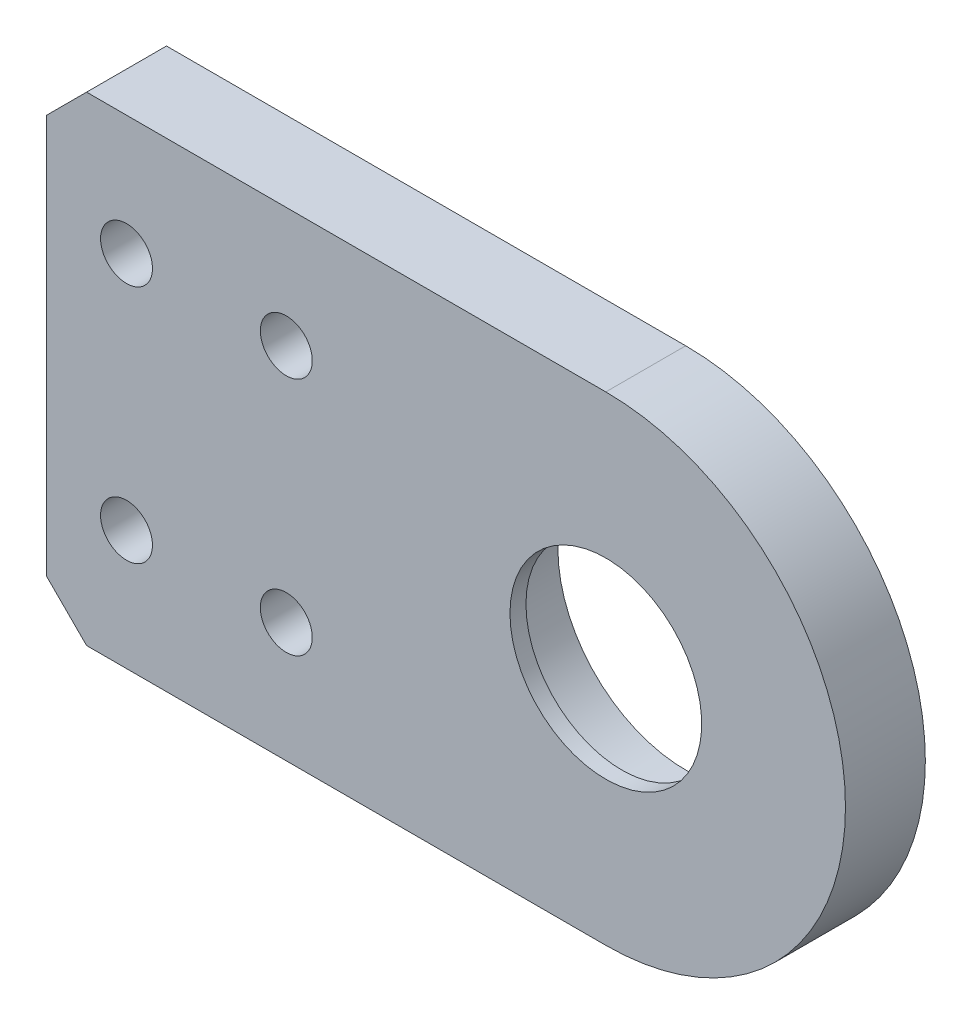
ISO-10303-21;
HEADER;
FILE_DESCRIPTION(('STEP AP214'),'2;1');
FILE_NAME('part.step','',(''),(''),'','','');
FILE_SCHEMA(('AUTOMOTIVE_DESIGN { 1 0 10303 214 1 1 1 1 }'));
ENDSEC;
DATA;
#1=APPLICATION_CONTEXT('core data for automotive mechanical design processes');
#2=APPLICATION_PROTOCOL_DEFINITION('international standard','automotive_design',2000,#1);
#3=PRODUCT_CONTEXT('',#1,'mechanical');
#4=PRODUCT('Part','Part','',(#3));
#5=PRODUCT_RELATED_PRODUCT_CATEGORY('part','',(#4));
#6=PRODUCT_DEFINITION_FORMATION('','',#4);
#7=PRODUCT_DEFINITION_CONTEXT('part definition',#1,'design');
#8=PRODUCT_DEFINITION('design','',#6,#7);
#9=PRODUCT_DEFINITION_SHAPE('','',#8);
#10=(LENGTH_UNIT() NAMED_UNIT(*) SI_UNIT(.MILLI.,.METRE.));
#11=(NAMED_UNIT(*) PLANE_ANGLE_UNIT() SI_UNIT($,.RADIAN.));
#12=(NAMED_UNIT(*) SI_UNIT($,.STERADIAN.) SOLID_ANGLE_UNIT());
#13=UNCERTAINTY_MEASURE_WITH_UNIT(LENGTH_MEASURE(1.E-05),#10,'distance_accuracy_value','');
#14=(GEOMETRIC_REPRESENTATION_CONTEXT(3) GLOBAL_UNCERTAINTY_ASSIGNED_CONTEXT((#13)) GLOBAL_UNIT_ASSIGNED_CONTEXT((#10,
#11,#12)) REPRESENTATION_CONTEXT('',''));
#15=CARTESIAN_POINT('',(0.,0.,0.));
#16=DIRECTION('',(0.,0.,1.));
#17=DIRECTION('',(1.,0.,0.));
#18=AXIS2_PLACEMENT_3D('',#15,#16,#17);
#19=CARTESIAN_POINT('',(20.,0.,8.));
#20=DIRECTION('',(0.,0.,-1.));
#21=DIRECTION('',(-1.,0.,0.));
#22=AXIS2_PLACEMENT_3D('',#19,#20,#21);
#23=CYLINDRICAL_SURFACE('',#22,16.);
#24=CARTESIAN_POINT('',(20.,0.,8.));
#25=DIRECTION('',(0.,0.,-1.));
#26=DIRECTION('',(-1.,0.,0.));
#27=AXIS2_PLACEMENT_3D('',#24,#25,#26);
#28=CIRCLE('',#27,16.);
#29=CARTESIAN_POINT('',(3.99999999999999,0.,8.));
#30=VERTEX_POINT('',#29);
#31=EDGE_CURVE('E20',#30,#30,#28,.T.);
#32=ORIENTED_EDGE('',*,*,#31,.F.);
#33=EDGE_LOOP('',(#32));
#34=FACE_BOUND('',#33,.T.);
#35=CARTESIAN_POINT('',(20.,0.,0.));
#36=DIRECTION('',(0.,0.,-1.));
#37=DIRECTION('',(-1.,0.,0.));
#38=AXIS2_PLACEMENT_3D('',#35,#36,#37);
#39=CIRCLE('',#38,16.);
#40=CARTESIAN_POINT('',(3.99999999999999,0.,0.));
#41=VERTEX_POINT('',#40);
#42=EDGE_CURVE('E167',#41,#41,#39,.T.);
#43=ORIENTED_EDGE('',*,*,#42,.T.);
#44=EDGE_LOOP('',(#43));
#45=FACE_BOUND('',#44,.T.);
#46=ADVANCED_FACE('F17',(#34,#45),#23,.F.);
#47=CARTESIAN_POINT('',(20.,0.,8.));
#48=DIRECTION('',(0.,0.,-1.));
#49=DIRECTION('',(-1.,0.,0.));
#50=AXIS2_PLACEMENT_3D('',#47,#48,#49);
#51=PLANE('',#50);
#52=CARTESIAN_POINT('',(20.,0.,8.));
#53=DIRECTION('',(0.,0.,-1.));
#54=DIRECTION('',(-1.,0.,0.));
#55=AXIS2_PLACEMENT_3D('',#52,#53,#54);
#56=CIRCLE('',#55,12.);
#57=CARTESIAN_POINT('',(7.99999999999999,0.,8.));
#58=VERTEX_POINT('',#57);
#59=EDGE_CURVE('E131',#58,#58,#56,.F.);
#60=ORIENTED_EDGE('',*,*,#59,.T.);
#61=EDGE_LOOP('',(#60));
#62=FACE_BOUND('',#61,.T.);
#63=ORIENTED_EDGE('',*,*,#31,.T.);
#64=EDGE_LOOP('',(#63));
#65=FACE_BOUND('',#64,.T.);
#66=ADVANCED_FACE('F174',(#62,#65),#51,.T.);
#67=CARTESIAN_POINT('',(0.,0.,0.));
#68=DIRECTION('',(0.,0.,1.));
#69=DIRECTION('',(1.,0.,0.));
#70=AXIS2_PLACEMENT_3D('',#67,#68,#69);
#71=PLANE('',#70);
#72=DIRECTION('',(-0.707106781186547,0.707106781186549,0.));
#73=VECTOR('',#72,1.);
#74=CARTESIAN_POINT('',(-45.,-30.,0.));
#75=LINE('',#74,#73);
#76=CARTESIAN_POINT('',(-45.,-30.,0.));
#77=VERTEX_POINT('',#76);
#78=CARTESIAN_POINT('',(-50.,-25.,0.));
#79=VERTEX_POINT('',#78);
#80=EDGE_CURVE('E108',#77,#79,#75,.T.);
#81=ORIENTED_EDGE('',*,*,#80,.T.);
#82=DIRECTION('',(0.,1.,0.));
#83=VECTOR('',#82,1.);
#84=CARTESIAN_POINT('',(-50.,30.,0.));
#85=LINE('',#84,#83);
#86=CARTESIAN_POINT('',(-50.,25.,0.));
#87=VERTEX_POINT('',#86);
#88=EDGE_CURVE('E129',#79,#87,#85,.T.);
#89=ORIENTED_EDGE('',*,*,#88,.T.);
#90=DIRECTION('',(0.707106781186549,0.707106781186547,0.));
#91=VECTOR('',#90,1.);
#92=CARTESIAN_POINT('',(-50.,25.,0.));
#93=LINE('',#92,#91);
#94=CARTESIAN_POINT('',(-45.,30.,0.));
#95=VERTEX_POINT('',#94);
#96=EDGE_CURVE('E119',#87,#95,#93,.T.);
#97=ORIENTED_EDGE('',*,*,#96,.T.);
#98=DIRECTION('',(1.,0.,0.));
#99=VECTOR('',#98,1.);
#100=CARTESIAN_POINT('',(-50.,30.,0.));
#101=LINE('',#100,#99);
#102=CARTESIAN_POINT('',(20.,30.,0.));
#103=VERTEX_POINT('',#102);
#104=EDGE_CURVE('E67',#95,#103,#101,.T.);
#105=ORIENTED_EDGE('',*,*,#104,.T.);
#106=CARTESIAN_POINT('',(20.,0.,0.));
#107=DIRECTION('',(0.,0.,-1.));
#108=DIRECTION('',(-1.,0.,0.));
#109=AXIS2_PLACEMENT_3D('',#106,#107,#108);
#110=CIRCLE('',#109,30.);
#111=CARTESIAN_POINT('',(20.,-30.,0.));
#112=VERTEX_POINT('',#111);
#113=EDGE_CURVE('E70',#112,#103,#110,.F.);
#114=ORIENTED_EDGE('',*,*,#113,.F.);
#115=DIRECTION('',(1.,0.,0.));
#116=VECTOR('',#115,1.);
#117=CARTESIAN_POINT('',(-50.,-30.,0.));
#118=LINE('',#117,#116);
#119=EDGE_CURVE('E74',#112,#77,#118,.F.);
#120=ORIENTED_EDGE('',*,*,#119,.T.);
#121=EDGE_LOOP('',(#81,#89,#97,#105,#114,#120));
#122=FACE_BOUND('',#121,.T.);
#123=CARTESIAN_POINT('',(-20.,15.,0.));
#124=DIRECTION('',(0.,0.,-1.));
#125=DIRECTION('',(-1.,0.,0.));
#126=AXIS2_PLACEMENT_3D('',#123,#124,#125);
#127=CIRCLE('',#126,3.25);
#128=CARTESIAN_POINT('',(-23.25,15.,0.));
#129=VERTEX_POINT('',#128);
#130=EDGE_CURVE('E156',#129,#129,#127,.F.);
#131=ORIENTED_EDGE('',*,*,#130,.T.);
#132=EDGE_LOOP('',(#131));
#133=FACE_BOUND('',#132,.T.);
#134=CARTESIAN_POINT('',(-40.,15.,0.));
#135=DIRECTION('',(0.,0.,-1.));
#136=DIRECTION('',(-1.,0.,0.));
#137=AXIS2_PLACEMENT_3D('',#134,#135,#136);
#138=CIRCLE('',#137,3.25);
#139=CARTESIAN_POINT('',(-43.25,15.,0.));
#140=VERTEX_POINT('',#139);
#141=EDGE_CURVE('E159',#140,#140,#138,.F.);
#142=ORIENTED_EDGE('',*,*,#141,.T.);
#143=EDGE_LOOP('',(#142));
#144=FACE_BOUND('',#143,.T.);
#145=CARTESIAN_POINT('',(-20.,-15.,0.));
#146=DIRECTION('',(0.,0.,-1.));
#147=DIRECTION('',(-1.,0.,0.));
#148=AXIS2_PLACEMENT_3D('',#145,#146,#147);
#149=CIRCLE('',#148,3.25);
#150=CARTESIAN_POINT('',(-23.25,-15.,0.));
#151=VERTEX_POINT('',#150);
#152=EDGE_CURVE('E162',#151,#151,#149,.F.);
#153=ORIENTED_EDGE('',*,*,#152,.T.);
#154=EDGE_LOOP('',(#153));
#155=FACE_BOUND('',#154,.T.);
#156=CARTESIAN_POINT('',(-40.,-15.,0.));
#157=DIRECTION('',(0.,0.,-1.));
#158=DIRECTION('',(-1.,0.,0.));
#159=AXIS2_PLACEMENT_3D('',#156,#157,#158);
#160=CIRCLE('',#159,3.25);
#161=CARTESIAN_POINT('',(-43.25,-15.,0.));
#162=VERTEX_POINT('',#161);
#163=EDGE_CURVE('E165',#162,#162,#160,.F.);
#164=ORIENTED_EDGE('',*,*,#163,.T.);
#165=EDGE_LOOP('',(#164));
#166=FACE_BOUND('',#165,.T.);
#167=ORIENTED_EDGE('',*,*,#42,.F.);
#168=EDGE_LOOP('',(#167));
#169=FACE_BOUND('',#168,.T.);
#170=ADVANCED_FACE('F72',(#122,#133,#144,#155,#166,#169),#71,.F.);
#171=CARTESIAN_POINT('',(-40.,-15.,10.));
#172=DIRECTION('',(0.,0.,-1.));
#173=DIRECTION('',(-1.,0.,0.));
#174=AXIS2_PLACEMENT_3D('',#171,#172,#173);
#175=CYLINDRICAL_SURFACE('',#174,3.25);
#176=ORIENTED_EDGE('',*,*,#163,.F.);
#177=EDGE_LOOP('',(#176));
#178=FACE_BOUND('',#177,.T.);
#179=CARTESIAN_POINT('',(-40.,-15.,10.));
#180=DIRECTION('',(0.,0.,-1.));
#181=DIRECTION('',(-1.,0.,0.));
#182=AXIS2_PLACEMENT_3D('',#179,#180,#181);
#183=CIRCLE('',#182,3.25);
#184=CARTESIAN_POINT('',(-43.25,-15.,10.));
#185=VERTEX_POINT('',#184);
#186=EDGE_CURVE('E151',#185,#185,#183,.T.);
#187=ORIENTED_EDGE('',*,*,#186,.F.);
#188=EDGE_LOOP('',(#187));
#189=FACE_BOUND('',#188,.T.);
#190=ADVANCED_FACE('F225',(#178,#189),#175,.F.);
#191=CARTESIAN_POINT('',(-20.,-15.,10.));
#192=DIRECTION('',(0.,0.,-1.));
#193=DIRECTION('',(-1.,0.,0.));
#194=AXIS2_PLACEMENT_3D('',#191,#192,#193);
#195=CYLINDRICAL_SURFACE('',#194,3.25);
#196=ORIENTED_EDGE('',*,*,#152,.F.);
#197=EDGE_LOOP('',(#196));
#198=FACE_BOUND('',#197,.T.);
#199=CARTESIAN_POINT('',(-20.,-15.,10.));
#200=DIRECTION('',(0.,0.,-1.));
#201=DIRECTION('',(-1.,0.,0.));
#202=AXIS2_PLACEMENT_3D('',#199,#200,#201);
#203=CIRCLE('',#202,3.25);
#204=CARTESIAN_POINT('',(-23.25,-15.,10.));
#205=VERTEX_POINT('',#204);
#206=EDGE_CURVE('E148',#205,#205,#203,.T.);
#207=ORIENTED_EDGE('',*,*,#206,.F.);
#208=EDGE_LOOP('',(#207));
#209=FACE_BOUND('',#208,.T.);
#210=ADVANCED_FACE('F221',(#198,#209),#195,.F.);
#211=CARTESIAN_POINT('',(-40.,15.,10.));
#212=DIRECTION('',(0.,0.,-1.));
#213=DIRECTION('',(-1.,0.,0.));
#214=AXIS2_PLACEMENT_3D('',#211,#212,#213);
#215=CYLINDRICAL_SURFACE('',#214,3.25);
#216=ORIENTED_EDGE('',*,*,#141,.F.);
#217=EDGE_LOOP('',(#216));
#218=FACE_BOUND('',#217,.T.);
#219=CARTESIAN_POINT('',(-40.,15.,10.));
#220=DIRECTION('',(0.,0.,-1.));
#221=DIRECTION('',(-1.,0.,0.));
#222=AXIS2_PLACEMENT_3D('',#219,#220,#221);
#223=CIRCLE('',#222,3.25);
#224=CARTESIAN_POINT('',(-43.25,15.,10.));
#225=VERTEX_POINT('',#224);
#226=EDGE_CURVE('E145',#225,#225,#223,.T.);
#227=ORIENTED_EDGE('',*,*,#226,.F.);
#228=EDGE_LOOP('',(#227));
#229=FACE_BOUND('',#228,.T.);
#230=ADVANCED_FACE('F217',(#218,#229),#215,.F.);
#231=CARTESIAN_POINT('',(-20.,15.,10.));
#232=DIRECTION('',(0.,0.,-1.));
#233=DIRECTION('',(-1.,0.,0.));
#234=AXIS2_PLACEMENT_3D('',#231,#232,#233);
#235=CYLINDRICAL_SURFACE('',#234,3.25);
#236=ORIENTED_EDGE('',*,*,#130,.F.);
#237=EDGE_LOOP('',(#236));
#238=FACE_BOUND('',#237,.T.);
#239=CARTESIAN_POINT('',(-20.,15.,10.));
#240=DIRECTION('',(0.,0.,-1.));
#241=DIRECTION('',(-1.,0.,0.));
#242=AXIS2_PLACEMENT_3D('',#239,#240,#241);
#243=CIRCLE('',#242,3.25);
#244=CARTESIAN_POINT('',(-23.25,15.,10.));
#245=VERTEX_POINT('',#244);
#246=EDGE_CURVE('E142',#245,#245,#243,.T.);
#247=ORIENTED_EDGE('',*,*,#246,.F.);
#248=EDGE_LOOP('',(#247));
#249=FACE_BOUND('',#248,.T.);
#250=ADVANCED_FACE('F213',(#238,#249),#235,.F.);
#251=CARTESIAN_POINT('',(20.,0.,10.));
#252=DIRECTION('',(0.,0.,-1.));
#253=DIRECTION('',(-1.,0.,0.));
#254=AXIS2_PLACEMENT_3D('',#251,#252,#253);
#255=CYLINDRICAL_SURFACE('',#254,12.);
#256=ORIENTED_EDGE('',*,*,#59,.F.);
#257=EDGE_LOOP('',(#256));
#258=FACE_BOUND('',#257,.T.);
#259=CARTESIAN_POINT('',(20.,0.,10.));
#260=DIRECTION('',(0.,0.,-1.));
#261=DIRECTION('',(-1.,0.,0.));
#262=AXIS2_PLACEMENT_3D('',#259,#260,#261);
#263=CIRCLE('',#262,12.);
#264=CARTESIAN_POINT('',(7.99999999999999,0.,10.));
#265=VERTEX_POINT('',#264);
#266=EDGE_CURVE('E113',#265,#265,#263,.T.);
#267=ORIENTED_EDGE('',*,*,#266,.F.);
#268=EDGE_LOOP('',(#267));
#269=FACE_BOUND('',#268,.T.);
#270=ADVANCED_FACE('F209',(#258,#269),#255,.F.);
#271=CARTESIAN_POINT('',(-50.,30.,10.));
#272=DIRECTION('',(1.,0.,0.));
#273=DIRECTION('',(0.,1.,0.));
#274=AXIS2_PLACEMENT_3D('',#271,#272,#273);
#275=PLANE('',#274);
#276=DIRECTION('',(0.,0.,1.));
#277=VECTOR('',#276,1.);
#278=CARTESIAN_POINT('',(-50.,-25.,10.));
#279=LINE('',#278,#277);
#280=CARTESIAN_POINT('',(-50.,-24.9999999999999,10.));
#281=VERTEX_POINT('',#280);
#282=EDGE_CURVE('E97',#79,#281,#279,.T.);
#283=ORIENTED_EDGE('',*,*,#282,.T.);
#284=DIRECTION('',(0.,1.,0.));
#285=VECTOR('',#284,1.);
#286=CARTESIAN_POINT('',(-50.,0.,10.));
#287=LINE('',#286,#285);
#288=CARTESIAN_POINT('',(-50.,25.,10.));
#289=VERTEX_POINT('',#288);
#290=EDGE_CURVE('E104',#289,#281,#287,.F.);
#291=ORIENTED_EDGE('',*,*,#290,.F.);
#292=DIRECTION('',(0.,0.,1.));
#293=VECTOR('',#292,1.);
#294=CARTESIAN_POINT('',(-50.,25.,10.));
#295=LINE('',#294,#293);
#296=EDGE_CURVE('E116',#289,#87,#295,.F.);
#297=ORIENTED_EDGE('',*,*,#296,.T.);
#298=ORIENTED_EDGE('',*,*,#88,.F.);
#299=EDGE_LOOP('',(#283,#291,#297,#298));
#300=FACE_BOUND('',#299,.T.);
#301=ADVANCED_FACE('F205',(#300),#275,.F.);
#302=CARTESIAN_POINT('',(-45.,-30.,10.));
#303=DIRECTION('',(0.707106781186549,0.707106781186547,0.));
#304=DIRECTION('',(-0.707106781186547,0.707106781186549,0.));
#305=AXIS2_PLACEMENT_3D('',#302,#303,#304);
#306=PLANE('',#305);
#307=ORIENTED_EDGE('',*,*,#282,.F.);
#308=ORIENTED_EDGE('',*,*,#80,.F.);
#309=DIRECTION('',(0.,0.,1.));
#310=VECTOR('',#309,1.);
#311=CARTESIAN_POINT('',(-45.,-30.,10.));
#312=LINE('',#311,#310);
#313=CARTESIAN_POINT('',(-45.,-30.,10.));
#314=VERTEX_POINT('',#313);
#315=EDGE_CURVE('E86',#77,#314,#312,.T.);
#316=ORIENTED_EDGE('',*,*,#315,.T.);
#317=DIRECTION('',(0.707106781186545,-0.707106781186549,0.));
#318=VECTOR('',#317,1.);
#319=CARTESIAN_POINT('',(-50.,-24.9999999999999,10.));
#320=LINE('',#319,#318);
#321=EDGE_CURVE('E100',#281,#314,#320,.T.);
#322=ORIENTED_EDGE('',*,*,#321,.F.);
#323=EDGE_LOOP('',(#307,#308,#316,#322));
#324=FACE_BOUND('',#323,.T.);
#325=ADVANCED_FACE('F202',(#324),#306,.F.);
#326=CARTESIAN_POINT('',(-50.,-30.,10.));
#327=DIRECTION('',(0.,1.,0.));
#328=DIRECTION('',(0.,0.,1.));
#329=AXIS2_PLACEMENT_3D('',#326,#327,#328);
#330=PLANE('',#329);
#331=DIRECTION('',(0.,0.,-1.));
#332=VECTOR('',#331,1.);
#333=CARTESIAN_POINT('',(20.,-30.,10.));
#334=LINE('',#333,#332);
#335=CARTESIAN_POINT('',(20.,-30.,10.));
#336=VERTEX_POINT('',#335);
#337=EDGE_CURVE('E80',#336,#112,#334,.T.);
#338=ORIENTED_EDGE('',*,*,#337,.F.);
#339=DIRECTION('',(1.,0.,0.));
#340=VECTOR('',#339,1.);
#341=CARTESIAN_POINT('',(0.,-30.,10.));
#342=LINE('',#341,#340);
#343=EDGE_CURVE('E103',#314,#336,#342,.T.);
#344=ORIENTED_EDGE('',*,*,#343,.F.);
#345=ORIENTED_EDGE('',*,*,#315,.F.);
#346=ORIENTED_EDGE('',*,*,#119,.F.);
#347=EDGE_LOOP('',(#338,#344,#345,#346));
#348=FACE_BOUND('',#347,.T.);
#349=ADVANCED_FACE('F83',(#348),#330,.F.);
#350=CARTESIAN_POINT('',(20.,0.,10.));
#351=DIRECTION('',(0.,0.,-1.));
#352=DIRECTION('',(-1.,0.,0.));
#353=AXIS2_PLACEMENT_3D('',#350,#351,#352);
#354=CYLINDRICAL_SURFACE('',#353,30.);
#355=DIRECTION('',(0.,0.,-1.));
#356=VECTOR('',#355,1.);
#357=CARTESIAN_POINT('',(20.,30.,10.));
#358=LINE('',#357,#356);
#359=CARTESIAN_POINT('',(20.,30.,10.));
#360=VERTEX_POINT('',#359);
#361=EDGE_CURVE('E120',#103,#360,#358,.F.);
#362=ORIENTED_EDGE('',*,*,#361,.T.);
#363=CARTESIAN_POINT('',(20.,0.,10.));
#364=DIRECTION('',(0.,0.,-1.));
#365=DIRECTION('',(-1.,0.,0.));
#366=AXIS2_PLACEMENT_3D('',#363,#364,#365);
#367=CIRCLE('',#366,30.);
#368=EDGE_CURVE('E89',#336,#360,#367,.F.);
#369=ORIENTED_EDGE('',*,*,#368,.F.);
#370=ORIENTED_EDGE('',*,*,#337,.T.);
#371=ORIENTED_EDGE('',*,*,#113,.T.);
#372=EDGE_LOOP('',(#362,#369,#370,#371));
#373=FACE_BOUND('',#372,.T.);
#374=ADVANCED_FACE('F88',(#373),#354,.T.);
#375=CARTESIAN_POINT('',(-50.,30.,10.));
#376=DIRECTION('',(0.,-1.,0.));
#377=DIRECTION('',(0.,0.,-1.));
#378=AXIS2_PLACEMENT_3D('',#375,#376,#377);
#379=PLANE('',#378);
#380=ORIENTED_EDGE('',*,*,#104,.F.);
#381=DIRECTION('',(0.,0.,1.));
#382=VECTOR('',#381,1.);
#383=CARTESIAN_POINT('',(-45.,30.,10.));
#384=LINE('',#383,#382);
#385=CARTESIAN_POINT('',(-45.,30.,10.));
#386=VERTEX_POINT('',#385);
#387=EDGE_CURVE('E35',#95,#386,#384,.T.);
#388=ORIENTED_EDGE('',*,*,#387,.T.);
#389=DIRECTION('',(1.,0.,0.));
#390=VECTOR('',#389,1.);
#391=CARTESIAN_POINT('',(0.,30.,10.));
#392=LINE('',#391,#390);
#393=EDGE_CURVE('E26',#360,#386,#392,.F.);
#394=ORIENTED_EDGE('',*,*,#393,.F.);
#395=ORIENTED_EDGE('',*,*,#361,.F.);
#396=EDGE_LOOP('',(#380,#388,#394,#395));
#397=FACE_BOUND('',#396,.T.);
#398=ADVANCED_FACE('F190',(#397),#379,.F.);
#399=CARTESIAN_POINT('',(-50.,25.,10.));
#400=DIRECTION('',(0.707106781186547,-0.707106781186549,0.));
#401=DIRECTION('',(0.707106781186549,0.707106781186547,0.));
#402=AXIS2_PLACEMENT_3D('',#399,#400,#401);
#403=PLANE('',#402);
#404=ORIENTED_EDGE('',*,*,#387,.F.);
#405=ORIENTED_EDGE('',*,*,#96,.F.);
#406=ORIENTED_EDGE('',*,*,#296,.F.);
#407=DIRECTION('',(-0.707106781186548,-0.707106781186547,0.));
#408=VECTOR('',#407,1.);
#409=CARTESIAN_POINT('',(-45.,30.,10.));
#410=LINE('',#409,#408);
#411=EDGE_CURVE('E11',#386,#289,#410,.T.);
#412=ORIENTED_EDGE('',*,*,#411,.F.);
#413=EDGE_LOOP('',(#404,#405,#406,#412));
#414=FACE_BOUND('',#413,.T.);
#415=ADVANCED_FACE('F184',(#414),#403,.F.);
#416=CARTESIAN_POINT('',(0.,0.,10.));
#417=DIRECTION('',(0.,0.,1.));
#418=DIRECTION('',(1.,0.,0.));
#419=AXIS2_PLACEMENT_3D('',#416,#417,#418);
#420=PLANE('',#419);
#421=ORIENTED_EDGE('',*,*,#393,.T.);
#422=ORIENTED_EDGE('',*,*,#411,.T.);
#423=ORIENTED_EDGE('',*,*,#290,.T.);
#424=ORIENTED_EDGE('',*,*,#321,.T.);
#425=ORIENTED_EDGE('',*,*,#343,.T.);
#426=ORIENTED_EDGE('',*,*,#368,.T.);
#427=EDGE_LOOP('',(#421,#422,#423,#424,#425,#426));
#428=FACE_BOUND('',#427,.T.);
#429=ORIENTED_EDGE('',*,*,#266,.T.);
#430=EDGE_LOOP('',(#429));
#431=FACE_BOUND('',#430,.T.);
#432=ORIENTED_EDGE('',*,*,#246,.T.);
#433=EDGE_LOOP('',(#432));
#434=FACE_BOUND('',#433,.T.);
#435=ORIENTED_EDGE('',*,*,#226,.T.);
#436=EDGE_LOOP('',(#435));
#437=FACE_BOUND('',#436,.T.);
#438=ORIENTED_EDGE('',*,*,#206,.T.);
#439=EDGE_LOOP('',(#438));
#440=FACE_BOUND('',#439,.T.);
#441=ORIENTED_EDGE('',*,*,#186,.T.);
#442=EDGE_LOOP('',(#441));
#443=FACE_BOUND('',#442,.T.);
#444=ADVANCED_FACE('F182',(#428,#431,#434,#437,#440,#443),#420,.T.);
#445=CLOSED_SHELL('',(#46,#66,#170,#190,#210,#230,#250,#270,#301,#325,#349,#374,#398,#415,#444));
#446=MANIFOLD_SOLID_BREP('B1',#445);
#447=ADVANCED_BREP_SHAPE_REPRESENTATION('',(#18,#446),#14);
#448=SHAPE_DEFINITION_REPRESENTATION(#9,#447);
ENDSEC;
END-ISO-10303-21;
